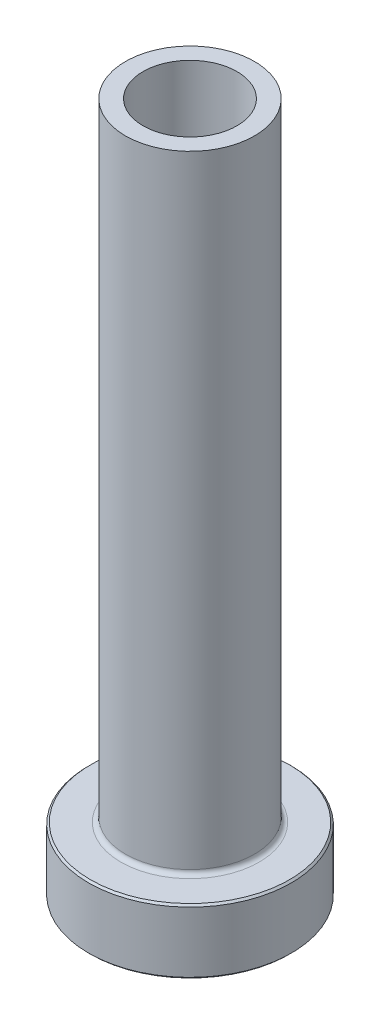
from build123d import *

# Parameters (mm, degrees)
FILLET1_R     = 0.5
CHAMFER1_SIZE = 0.2
CHAMFER3_SIZE = 0.5


with BuildPart() as part:
    # Sketch1 → Revolve1 (revolve)
    with BuildSketch(Plane.XY, mode=Mode.PRIVATE) as revolve1_sk:
        Polygon((-5.1, 75), (-7, 75), (-7, 7), (-11, 7), (-11, 0), (-5.35, 0), (-5.35, 8), (-5.1, 20), align=None)
    revolve(revolve1_sk.sketch.rotate(Axis((0, 92.187680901, 0), (0, -1, 0)), 270), axis=Axis((0, 92.187680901, 0), (0, -1, 0)))

    # Fillet1
    fillet1_edges = [part.edges().sort_by_distance(p)[0] for p in [
        (0, 7, -7),
    ]]
    fillet(fillet1_edges, radius=FILLET1_R)

    # Chamfer1
    chamfer1_edges = [part.edges().sort_by_distance(p)[0] for p in [
        (0, 0, -11),
        (0, 7, -11),
    ]]
    chamfer(chamfer1_edges, length=CHAMFER1_SIZE)

    # Chamfer3
    chamfer3_edges = [part.edges().sort_by_distance(p)[0] for p in [
        (0, 0, -5.35),
    ]]
    chamfer(chamfer3_edges, length=CHAMFER3_SIZE)


solid = part.part
